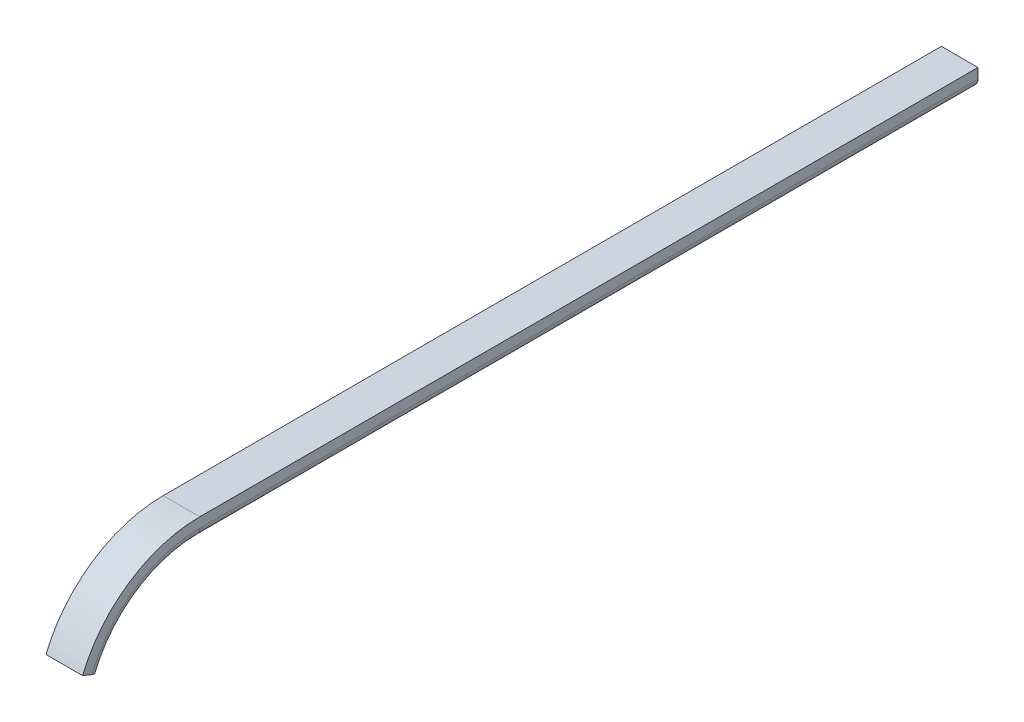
ISO-10303-21;
HEADER;
FILE_DESCRIPTION(('STEP AP214'),'2;1');
FILE_NAME('part.step','',(''),(''),'','','');
FILE_SCHEMA(('AUTOMOTIVE_DESIGN { 1 0 10303 214 1 1 1 1 }'));
ENDSEC;
DATA;
#1=APPLICATION_CONTEXT('core data for automotive mechanical design processes');
#2=APPLICATION_PROTOCOL_DEFINITION('international standard','automotive_design',2000,#1);
#3=PRODUCT_CONTEXT('',#1,'mechanical');
#4=PRODUCT('Part','Part','',(#3));
#5=PRODUCT_RELATED_PRODUCT_CATEGORY('part','',(#4));
#6=PRODUCT_DEFINITION_FORMATION('','',#4);
#7=PRODUCT_DEFINITION_CONTEXT('part definition',#1,'design');
#8=PRODUCT_DEFINITION('design','',#6,#7);
#9=PRODUCT_DEFINITION_SHAPE('','',#8);
#10=(LENGTH_UNIT() NAMED_UNIT(*) SI_UNIT(.MILLI.,.METRE.));
#11=(NAMED_UNIT(*) PLANE_ANGLE_UNIT() SI_UNIT($,.RADIAN.));
#12=(NAMED_UNIT(*) SI_UNIT($,.STERADIAN.) SOLID_ANGLE_UNIT());
#13=UNCERTAINTY_MEASURE_WITH_UNIT(LENGTH_MEASURE(1.E-05),#10,'distance_accuracy_value','');
#14=(GEOMETRIC_REPRESENTATION_CONTEXT(3) GLOBAL_UNCERTAINTY_ASSIGNED_CONTEXT((#13)) GLOBAL_UNIT_ASSIGNED_CONTEXT((#10,
#11,#12)) REPRESENTATION_CONTEXT('',''));
#15=CARTESIAN_POINT('',(0.,0.,0.));
#16=DIRECTION('',(0.,0.,1.));
#17=DIRECTION('',(1.,0.,0.));
#18=AXIS2_PLACEMENT_3D('',#15,#16,#17);
#19=CARTESIAN_POINT('',(0.,0.,425.));
#20=DIRECTION('',(1.,0.,0.));
#21=DIRECTION('',(0.,1.,0.));
#22=AXIS2_PLACEMENT_3D('',#19,#20,#21);
#23=PLANE('',#22);
#24=DIRECTION('',(0.,-1.,0.));
#25=VECTOR('',#24,1.);
#26=CARTESIAN_POINT('',(0.,0.,0.));
#27=LINE('',#26,#25);
#28=CARTESIAN_POINT('',(0.,0.,0.));
#29=VERTEX_POINT('',#28);
#30=CARTESIAN_POINT('',(0.,-3.,0.));
#31=VERTEX_POINT('',#30);
#32=EDGE_CURVE('E157',#29,#31,#27,.T.);
#33=ORIENTED_EDGE('',*,*,#32,.T.);
#34=DIRECTION('',(0.,0.,-1.));
#35=VECTOR('',#34,1.);
#36=CARTESIAN_POINT('',(0.,-3.,425.));
#37=LINE('',#36,#35);
#38=CARTESIAN_POINT('',(0.,-3.,425.));
#39=VERTEX_POINT('',#38);
#40=EDGE_CURVE('E11',#39,#31,#37,.T.);
#41=ORIENTED_EDGE('',*,*,#40,.F.);
#42=CARTESIAN_POINT('',(0.,-69.,425.));
#43=DIRECTION('',(-1.,0.,0.));
#44=DIRECTION('',(0.,0.,1.));
#45=AXIS2_PLACEMENT_3D('',#42,#43,#44);
#46=CIRCLE('',#45,66.);
#47=CARTESIAN_POINT('',(0.,-44.27596483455,486.194134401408));
#48=VERTEX_POINT('',#47);
#49=EDGE_CURVE('E272',#48,#39,#46,.T.);
#50=ORIENTED_EDGE('',*,*,#49,.F.);
#51=DIRECTION('',(0.,-0.37460659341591,-0.927183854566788));
#52=VECTOR('',#51,1.);
#53=CARTESIAN_POINT('',(0.,-44.27596483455,486.194134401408));
#54=LINE('',#53,#52);
#55=CARTESIAN_POINT('',(0.,-43.1521450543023,488.975685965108));
#56=VERTEX_POINT('',#55);
#57=EDGE_CURVE('E153',#56,#48,#54,.T.);
#58=ORIENTED_EDGE('',*,*,#57,.F.);
#59=CARTESIAN_POINT('',(0.,-69.,425.));
#60=DIRECTION('',(-1.,0.,0.));
#61=DIRECTION('',(0.,0.,1.));
#62=AXIS2_PLACEMENT_3D('',#59,#60,#61);
#63=CIRCLE('',#62,69.);
#64=CARTESIAN_POINT('',(0.,0.,425.));
#65=VERTEX_POINT('',#64);
#66=EDGE_CURVE('E151',#56,#65,#63,.T.);
#67=ORIENTED_EDGE('',*,*,#66,.T.);
#68=DIRECTION('',(0.,0.,-1.));
#69=VECTOR('',#68,1.);
#70=CARTESIAN_POINT('',(0.,0.,425.));
#71=LINE('',#70,#69);
#72=EDGE_CURVE('E138',#65,#29,#71,.T.);
#73=ORIENTED_EDGE('',*,*,#72,.T.);
#74=EDGE_LOOP('',(#33,#41,#50,#58,#67,#73));
#75=FACE_BOUND('',#74,.T.);
#76=ADVANCED_FACE('F32',(#75),#23,.F.);
#77=CARTESIAN_POINT('',(0.,-3.,425.));
#78=DIRECTION('',(0.,1.,0.));
#79=DIRECTION('',(-1.,0.,0.));
#80=AXIS2_PLACEMENT_3D('',#77,#78,#79);
#81=PLANE('',#80);
#82=DIRECTION('',(1.,0.,0.));
#83=VECTOR('',#82,1.);
#84=CARTESIAN_POINT('',(0.,-3.,0.));
#85=LINE('',#84,#83);
#86=CARTESIAN_POINT('',(17.,-3.,0.));
#87=VERTEX_POINT('',#86);
#88=EDGE_CURVE('E197',#31,#87,#85,.T.);
#89=ORIENTED_EDGE('',*,*,#88,.T.);
#90=DIRECTION('',(0.,0.,-1.));
#91=VECTOR('',#90,1.);
#92=CARTESIAN_POINT('',(17.,-3.,425.));
#93=LINE('',#92,#91);
#94=CARTESIAN_POINT('',(17.,-3.,425.));
#95=VERTEX_POINT('',#94);
#96=EDGE_CURVE('E39',#95,#87,#93,.T.);
#97=ORIENTED_EDGE('',*,*,#96,.F.);
#98=DIRECTION('',(1.,0.,0.));
#99=VECTOR('',#98,1.);
#100=CARTESIAN_POINT('',(0.,-3.,425.));
#101=LINE('',#100,#99);
#102=EDGE_CURVE('E216',#39,#95,#101,.T.);
#103=ORIENTED_EDGE('',*,*,#102,.F.);
#104=ORIENTED_EDGE('',*,*,#40,.T.);
#105=EDGE_LOOP('',(#89,#97,#103,#104));
#106=FACE_BOUND('',#105,.T.);
#107=ADVANCED_FACE('F305',(#106),#81,.F.);
#108=CARTESIAN_POINT('',(17.,-3.,425.));
#109=DIRECTION('',(1.,0.,0.));
#110=DIRECTION('',(0.,0.,-1.));
#111=AXIS2_PLACEMENT_3D('',#108,#109,#110);
#112=PLANE('',#111);
#113=DIRECTION('',(0.,-1.,0.));
#114=VECTOR('',#113,1.);
#115=CARTESIAN_POINT('',(17.,-3.,0.));
#116=LINE('',#115,#114);
#117=CARTESIAN_POINT('',(17.,-5.49999999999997,0.));
#118=VERTEX_POINT('',#117);
#119=EDGE_CURVE('E189',#87,#118,#116,.T.);
#120=ORIENTED_EDGE('',*,*,#119,.T.);
#121=DIRECTION('',(0.,0.,-1.));
#122=VECTOR('',#121,1.);
#123=CARTESIAN_POINT('',(17.,-5.49999999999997,425.));
#124=LINE('',#123,#122);
#125=CARTESIAN_POINT('',(17.,-5.49999999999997,425.));
#126=VERTEX_POINT('',#125);
#127=EDGE_CURVE('E182',#126,#118,#124,.T.);
#128=ORIENTED_EDGE('',*,*,#127,.F.);
#129=CARTESIAN_POINT('',(17.,-69.,425.));
#130=DIRECTION('',(-1.,0.,0.));
#131=DIRECTION('',(0.,0.,1.));
#132=AXIS2_PLACEMENT_3D('',#129,#130,#131);
#133=CIRCLE('',#132,63.5);
#134=CARTESIAN_POINT('',(17.,-45.2124813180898,483.876174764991));
#135=VERTEX_POINT('',#134);
#136=EDGE_CURVE('E275',#135,#126,#133,.T.);
#137=ORIENTED_EDGE('',*,*,#136,.F.);
#138=DIRECTION('',(0.,-0.37460659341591,-0.927183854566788));
#139=VECTOR('',#138,1.);
#140=CARTESIAN_POINT('',(17.,-45.2124813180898,483.876174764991));
#141=LINE('',#140,#139);
#142=CARTESIAN_POINT('',(17.,-44.27596483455,486.194134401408));
#143=VERTEX_POINT('',#142);
#144=EDGE_CURVE('E320',#143,#135,#141,.T.);
#145=ORIENTED_EDGE('',*,*,#144,.F.);
#146=CARTESIAN_POINT('',(17.,-69.,425.));
#147=DIRECTION('',(-1.,0.,0.));
#148=DIRECTION('',(0.,0.,1.));
#149=AXIS2_PLACEMENT_3D('',#146,#147,#148);
#150=CIRCLE('',#149,66.);
#151=EDGE_CURVE('E191',#143,#95,#150,.T.);
#152=ORIENTED_EDGE('',*,*,#151,.T.);
#153=ORIENTED_EDGE('',*,*,#96,.T.);
#154=EDGE_LOOP('',(#120,#128,#137,#145,#152,#153));
#155=FACE_BOUND('',#154,.T.);
#156=ADVANCED_FACE('F188',(#155),#112,.F.);
#157=CARTESIAN_POINT('',(15.5,-5.5,425.));
#158=DIRECTION('',(0.,0.,-1.));
#159=DIRECTION('',(-1.,0.,0.));
#160=AXIS2_PLACEMENT_3D('',#157,#158,#159);
#161=CYLINDRICAL_SURFACE('',#160,1.5);
#162=CARTESIAN_POINT('',(15.5,-5.5,0.));
#163=DIRECTION('',(0.,0.,-1.));
#164=DIRECTION('',(1.,0.,0.));
#165=AXIS2_PLACEMENT_3D('',#162,#163,#164);
#166=CIRCLE('',#165,1.5);
#167=CARTESIAN_POINT('',(15.1371171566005,-6.955443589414,0.));
#168=VERTEX_POINT('',#167);
#169=EDGE_CURVE('E199',#118,#168,#166,.T.);
#170=ORIENTED_EDGE('',*,*,#169,.T.);
#171=DIRECTION('',(0.,0.,-1.));
#172=VECTOR('',#171,1.);
#173=CARTESIAN_POINT('',(15.1371171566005,-6.955443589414,425.));
#174=LINE('',#173,#172);
#175=CARTESIAN_POINT('',(15.1371171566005,-6.955443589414,425.));
#176=VERTEX_POINT('',#175);
#177=EDGE_CURVE('E179',#176,#168,#174,.T.);
#178=ORIENTED_EDGE('',*,*,#177,.F.);
#179=CARTESIAN_POINT('',(15.5,-5.5,425.));
#180=DIRECTION('',(0.,0.,-1.));
#181=DIRECTION('',(1.,0.,0.));
#182=AXIS2_PLACEMENT_3D('',#179,#180,#181);
#183=CIRCLE('',#182,1.5);
#184=EDGE_CURVE('E218',#126,#176,#183,.T.);
#185=ORIENTED_EDGE('',*,*,#184,.F.);
#186=ORIENTED_EDGE('',*,*,#127,.T.);
#187=EDGE_LOOP('',(#170,#178,#185,#186));
#188=FACE_BOUND('',#187,.T.);
#189=ADVANCED_FACE('F302',(#188),#161,.F.);
#190=CARTESIAN_POINT('',(9.2996517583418,-5.5,425.));
#191=DIRECTION('',(-0.241921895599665,-0.970295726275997,0.));
#192=DIRECTION('',(0.970295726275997,-0.241921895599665,0.));
#193=AXIS2_PLACEMENT_3D('',#190,#191,#192);
#194=PLANE('',#193);
#195=DIRECTION('',(-0.970295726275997,0.241921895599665,0.));
#196=VECTOR('',#195,1.);
#197=CARTESIAN_POINT('',(9.2996517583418,-5.5,0.));
#198=LINE('',#197,#196);
#199=CARTESIAN_POINT('',(9.2996517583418,-5.5,0.));
#200=VERTEX_POINT('',#199);
#201=EDGE_CURVE('E201',#168,#200,#198,.T.);
#202=ORIENTED_EDGE('',*,*,#201,.T.);
#203=DIRECTION('',(0.,0.,-1.));
#204=VECTOR('',#203,1.);
#205=CARTESIAN_POINT('',(9.2996517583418,-5.5,425.));
#206=LINE('',#205,#204);
#207=CARTESIAN_POINT('',(9.2996517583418,-5.5,425.));
#208=VERTEX_POINT('',#207);
#209=EDGE_CURVE('E176',#208,#200,#206,.T.);
#210=ORIENTED_EDGE('',*,*,#209,.F.);
#211=DIRECTION('',(-0.970295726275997,0.241921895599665,0.));
#212=VECTOR('',#211,1.);
#213=CARTESIAN_POINT('',(9.2996517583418,-5.5,425.));
#214=LINE('',#213,#212);
#215=EDGE_CURVE('E221',#176,#208,#214,.T.);
#216=ORIENTED_EDGE('',*,*,#215,.F.);
#217=ORIENTED_EDGE('',*,*,#177,.T.);
#218=EDGE_LOOP('',(#202,#210,#216,#217));
#219=FACE_BOUND('',#218,.T.);
#220=ADVANCED_FACE('F291',(#219),#194,.F.);
#221=CARTESIAN_POINT('',(8.57388607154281,-8.41088717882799,425.));
#222=DIRECTION('',(0.970295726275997,-0.241921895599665,0.));
#223=DIRECTION('',(0.241921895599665,0.970295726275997,0.));
#224=AXIS2_PLACEMENT_3D('',#221,#222,#223);
#225=PLANE('',#224);
#226=DIRECTION('',(-0.241921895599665,-0.970295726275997,0.));
#227=VECTOR('',#226,1.);
#228=CARTESIAN_POINT('',(8.57388607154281,-8.41088717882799,0.));
#229=LINE('',#228,#227);
#230=CARTESIAN_POINT('',(8.57388607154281,-8.41088717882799,0.));
#231=VERTEX_POINT('',#230);
#232=EDGE_CURVE('E207',#200,#231,#229,.T.);
#233=ORIENTED_EDGE('',*,*,#232,.T.);
#234=DIRECTION('',(0.,0.,-1.));
#235=VECTOR('',#234,1.);
#236=CARTESIAN_POINT('',(8.57388607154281,-8.41088717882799,425.));
#237=LINE('',#236,#235);
#238=CARTESIAN_POINT('',(8.57388607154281,-8.41088717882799,425.));
#239=VERTEX_POINT('',#238);
#240=EDGE_CURVE('E173',#239,#231,#237,.T.);
#241=ORIENTED_EDGE('',*,*,#240,.F.);
#242=DIRECTION('',(-0.241921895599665,-0.970295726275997,0.));
#243=VECTOR('',#242,1.);
#244=CARTESIAN_POINT('',(8.57388607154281,-8.41088717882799,425.));
#245=LINE('',#244,#243);
#246=EDGE_CURVE('E224',#208,#239,#245,.T.);
#247=ORIENTED_EDGE('',*,*,#246,.F.);
#248=ORIENTED_EDGE('',*,*,#209,.T.);
#249=EDGE_LOOP('',(#233,#241,#247,#248));
#250=FACE_BOUND('',#249,.T.);
#251=ADVANCED_FACE('F294',(#250),#225,.F.);
#252=CARTESIAN_POINT('',(14.4113514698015,-9.86633076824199,425.));
#253=DIRECTION('',(0.241921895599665,0.970295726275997,0.));
#254=DIRECTION('',(-0.970295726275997,0.241921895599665,0.));
#255=AXIS2_PLACEMENT_3D('',#252,#253,#254);
#256=PLANE('',#255);
#257=DIRECTION('',(0.970295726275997,-0.241921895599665,0.));
#258=VECTOR('',#257,1.);
#259=CARTESIAN_POINT('',(14.4113514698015,-9.86633076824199,0.));
#260=LINE('',#259,#258);
#261=CARTESIAN_POINT('',(14.4113514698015,-9.86633076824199,0.));
#262=VERTEX_POINT('',#261);
#263=EDGE_CURVE('E209',#231,#262,#260,.T.);
#264=ORIENTED_EDGE('',*,*,#263,.T.);
#265=DIRECTION('',(0.,0.,-1.));
#266=VECTOR('',#265,1.);
#267=CARTESIAN_POINT('',(14.4113514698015,-9.86633076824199,425.));
#268=LINE('',#267,#266);
#269=CARTESIAN_POINT('',(14.4113514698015,-9.86633076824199,425.));
#270=VERTEX_POINT('',#269);
#271=EDGE_CURVE('E170',#270,#262,#268,.T.);
#272=ORIENTED_EDGE('',*,*,#271,.F.);
#273=DIRECTION('',(0.970295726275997,-0.241921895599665,0.));
#274=VECTOR('',#273,1.);
#275=CARTESIAN_POINT('',(14.4113514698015,-9.86633076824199,425.));
#276=LINE('',#275,#274);
#277=EDGE_CURVE('E164',#239,#270,#276,.T.);
#278=ORIENTED_EDGE('',*,*,#277,.F.);
#279=ORIENTED_EDGE('',*,*,#240,.T.);
#280=EDGE_LOOP('',(#264,#272,#278,#279));
#281=FACE_BOUND('',#280,.T.);
#282=ADVANCED_FACE('F237',(#281),#256,.F.);
#283=CARTESIAN_POINT('',(15.5,-5.5,425.));
#284=DIRECTION('',(0.,0.,-1.));
#285=DIRECTION('',(-1.,0.,0.));
#286=AXIS2_PLACEMENT_3D('',#283,#284,#285);
#287=CYLINDRICAL_SURFACE('',#286,4.5);
#288=CARTESIAN_POINT('',(15.5,-5.5,0.));
#289=DIRECTION('',(0.,0.,1.));
#290=DIRECTION('',(-1.,0.,0.));
#291=AXIS2_PLACEMENT_3D('',#288,#289,#290);
#292=CIRCLE('',#291,4.5);
#293=CARTESIAN_POINT('',(20.,-5.5,0.));
#294=VERTEX_POINT('',#293);
#295=EDGE_CURVE('E211',#262,#294,#292,.T.);
#296=ORIENTED_EDGE('',*,*,#295,.T.);
#297=DIRECTION('',(0.,0.,-1.));
#298=VECTOR('',#297,1.);
#299=CARTESIAN_POINT('',(20.,-5.5,425.));
#300=LINE('',#299,#298);
#301=CARTESIAN_POINT('',(20.,-5.5,425.));
#302=VERTEX_POINT('',#301);
#303=EDGE_CURVE('E54',#302,#294,#300,.T.);
#304=ORIENTED_EDGE('',*,*,#303,.F.);
#305=CARTESIAN_POINT('',(15.5,-5.5,425.));
#306=DIRECTION('',(0.,0.,1.));
#307=DIRECTION('',(-1.,0.,0.));
#308=AXIS2_PLACEMENT_3D('',#305,#306,#307);
#309=CIRCLE('',#308,4.5);
#310=EDGE_CURVE('E161',#270,#302,#309,.T.);
#311=ORIENTED_EDGE('',*,*,#310,.F.);
#312=ORIENTED_EDGE('',*,*,#271,.T.);
#313=EDGE_LOOP('',(#296,#304,#311,#312));
#314=FACE_BOUND('',#313,.T.);
#315=ADVANCED_FACE('F240',(#314),#287,.T.);
#316=CARTESIAN_POINT('',(20.,0.,425.));
#317=DIRECTION('',(-1.,0.,0.));
#318=DIRECTION('',(0.,0.,1.));
#319=AXIS2_PLACEMENT_3D('',#316,#317,#318);
#320=PLANE('',#319);
#321=DIRECTION('',(0.,1.,0.));
#322=VECTOR('',#321,1.);
#323=CARTESIAN_POINT('',(20.,0.,0.));
#324=LINE('',#323,#322);
#325=CARTESIAN_POINT('',(20.,0.,0.));
#326=VERTEX_POINT('',#325);
#327=EDGE_CURVE('E213',#294,#326,#324,.T.);
#328=ORIENTED_EDGE('',*,*,#327,.T.);
#329=DIRECTION('',(0.,0.,-1.));
#330=VECTOR('',#329,1.);
#331=CARTESIAN_POINT('',(20.,0.,425.));
#332=LINE('',#331,#330);
#333=CARTESIAN_POINT('',(20.,0.,425.));
#334=VERTEX_POINT('',#333);
#335=EDGE_CURVE('E46',#334,#326,#332,.T.);
#336=ORIENTED_EDGE('',*,*,#335,.F.);
#337=CARTESIAN_POINT('',(20.,-69.,425.));
#338=DIRECTION('',(-1.,0.,0.));
#339=DIRECTION('',(0.,0.,1.));
#340=AXIS2_PLACEMENT_3D('',#337,#338,#339);
#341=CIRCLE('',#340,69.);
#342=CARTESIAN_POINT('',(20.,-43.1521450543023,488.975685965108));
#343=VERTEX_POINT('',#342);
#344=EDGE_CURVE('E158',#343,#334,#341,.T.);
#345=ORIENTED_EDGE('',*,*,#344,.F.);
#346=DIRECTION('',(0.,0.37460659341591,0.927183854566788));
#347=VECTOR('',#346,1.);
#348=CARTESIAN_POINT('',(20.,-43.1521450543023,488.975685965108));
#349=LINE('',#348,#347);
#350=CARTESIAN_POINT('',(20.,-45.2124813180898,483.876174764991));
#351=VERTEX_POINT('',#350);
#352=EDGE_CURVE('E259',#351,#343,#349,.T.);
#353=ORIENTED_EDGE('',*,*,#352,.F.);
#354=CARTESIAN_POINT('',(20.,-69.,425.));
#355=DIRECTION('',(-1.,0.,0.));
#356=DIRECTION('',(0.,0.,1.));
#357=AXIS2_PLACEMENT_3D('',#354,#355,#356);
#358=CIRCLE('',#357,63.5);
#359=EDGE_CURVE('E246',#351,#302,#358,.T.);
#360=ORIENTED_EDGE('',*,*,#359,.T.);
#361=ORIENTED_EDGE('',*,*,#303,.T.);
#362=EDGE_LOOP('',(#328,#336,#345,#353,#360,#361));
#363=FACE_BOUND('',#362,.T.);
#364=ADVANCED_FACE('F256',(#363),#320,.F.);
#365=CARTESIAN_POINT('',(0.,0.,425.));
#366=DIRECTION('',(0.,-1.,0.));
#367=DIRECTION('',(0.,0.,-1.));
#368=AXIS2_PLACEMENT_3D('',#365,#366,#367);
#369=PLANE('',#368);
#370=DIRECTION('',(-1.,0.,0.));
#371=VECTOR('',#370,1.);
#372=CARTESIAN_POINT('',(0.,0.,0.));
#373=LINE('',#372,#371);
#374=EDGE_CURVE('E145',#326,#29,#373,.T.);
#375=ORIENTED_EDGE('',*,*,#374,.T.);
#376=ORIENTED_EDGE('',*,*,#72,.F.);
#377=DIRECTION('',(-1.,0.,0.));
#378=VECTOR('',#377,1.);
#379=CARTESIAN_POINT('',(0.,0.,425.));
#380=LINE('',#379,#378);
#381=EDGE_CURVE('E142',#334,#65,#380,.T.);
#382=ORIENTED_EDGE('',*,*,#381,.F.);
#383=ORIENTED_EDGE('',*,*,#335,.T.);
#384=EDGE_LOOP('',(#375,#376,#382,#383));
#385=FACE_BOUND('',#384,.T.);
#386=ADVANCED_FACE('F140',(#385),#369,.F.);
#387=CARTESIAN_POINT('',(15.5,-5.5,0.));
#388=DIRECTION('',(0.,0.,1.));
#389=DIRECTION('',(1.,0.,0.));
#390=AXIS2_PLACEMENT_3D('',#387,#388,#389);
#391=PLANE('',#390);
#392=ORIENTED_EDGE('',*,*,#32,.F.);
#393=ORIENTED_EDGE('',*,*,#374,.F.);
#394=ORIENTED_EDGE('',*,*,#327,.F.);
#395=ORIENTED_EDGE('',*,*,#295,.F.);
#396=ORIENTED_EDGE('',*,*,#263,.F.);
#397=ORIENTED_EDGE('',*,*,#232,.F.);
#398=ORIENTED_EDGE('',*,*,#201,.F.);
#399=ORIENTED_EDGE('',*,*,#169,.F.);
#400=ORIENTED_EDGE('',*,*,#119,.F.);
#401=ORIENTED_EDGE('',*,*,#88,.F.);
#402=EDGE_LOOP('',(#392,#393,#394,#395,#396,#397,#398,#399,#400,#401));
#403=FACE_BOUND('',#402,.T.);
#404=ADVANCED_FACE('F196',(#403),#391,.F.);
#405=CARTESIAN_POINT('',(-2.53690537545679,-69.,425.));
#406=DIRECTION('',(-1.,0.,0.));
#407=DIRECTION('',(0.,0.,1.));
#408=AXIS2_PLACEMENT_3D('',#405,#406,#407);
#409=CYLINDRICAL_SURFACE('',#408,69.);
#410=ORIENTED_EDGE('',*,*,#344,.T.);
#411=ORIENTED_EDGE('',*,*,#381,.T.);
#412=ORIENTED_EDGE('',*,*,#66,.F.);
#413=DIRECTION('',(-1.,0.,0.));
#414=VECTOR('',#413,1.);
#415=CARTESIAN_POINT('',(0.,-43.1521450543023,488.975685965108));
#416=LINE('',#415,#414);
#417=EDGE_CURVE('E265',#343,#56,#416,.T.);
#418=ORIENTED_EDGE('',*,*,#417,.F.);
#419=EDGE_LOOP('',(#410,#411,#412,#418));
#420=FACE_BOUND('',#419,.T.);
#421=ADVANCED_FACE('F160',(#420),#409,.T.);
#422=CARTESIAN_POINT('',(15.5,-69.,425.));
#423=DIRECTION('',(-1.,0.,0.));
#424=DIRECTION('',(0.,0.,1.));
#425=AXIS2_PLACEMENT_3D('',#422,#423,#424);
#426=TOROIDAL_SURFACE('',#425,63.5,4.50000000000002);
#427=CARTESIAN_POINT('',(14.4113514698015,-69.,425.));
#428=DIRECTION('',(-1.,0.,0.));
#429=DIRECTION('',(0.,0.,1.));
#430=AXIS2_PLACEMENT_3D('',#427,#428,#429);
#431=CIRCLE('',#430,59.133669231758);
#432=CARTESIAN_POINT('',(14.4113514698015,-46.848137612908,479.827783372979));
#433=VERTEX_POINT('',#432);
#434=EDGE_CURVE('E233',#433,#270,#431,.T.);
#435=ORIENTED_EDGE('',*,*,#434,.T.);
#436=ORIENTED_EDGE('',*,*,#310,.T.);
#437=ORIENTED_EDGE('',*,*,#359,.F.);
#438=CARTESIAN_POINT('',(15.5,-45.2124813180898,483.876174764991));
#439=DIRECTION('',(0.,-0.927183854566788,0.37460659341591));
#440=DIRECTION('',(-1.,0.,0.));
#441=AXIS2_PLACEMENT_3D('',#438,#439,#440);
#442=CIRCLE('',#441,4.50000000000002);
#443=EDGE_CURVE('E245',#433,#351,#442,.T.);
#444=ORIENTED_EDGE('',*,*,#443,.F.);
#445=EDGE_LOOP('',(#435,#436,#437,#444));
#446=FACE_BOUND('',#445,.T.);
#447=ADVANCED_FACE('F243',(#446),#426,.T.);
#448=CARTESIAN_POINT('',(8.57388607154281,-69.,425.));
#449=DIRECTION('',(-1.,0.,0.));
#450=DIRECTION('',(0.,0.,1.));
#451=AXIS2_PLACEMENT_3D('',#448,#449,#450);
#452=CONICAL_SURFACE('',#451,60.589112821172,0.244346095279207);
#453=CARTESIAN_POINT('',(8.57388607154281,-69.,425.));
#454=DIRECTION('',(-1.,0.,0.));
#455=DIRECTION('',(0.,0.,1.));
#456=AXIS2_PLACEMENT_3D('',#453,#454,#455);
#457=CIRCLE('',#456,60.589112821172);
#458=CARTESIAN_POINT('',(8.57388607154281,-46.3029188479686,481.177247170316));
#459=VERTEX_POINT('',#458);
#460=EDGE_CURVE('E235',#459,#239,#457,.T.);
#461=ORIENTED_EDGE('',*,*,#460,.T.);
#462=ORIENTED_EDGE('',*,*,#277,.T.);
#463=ORIENTED_EDGE('',*,*,#434,.F.);
#464=DIRECTION('',(0.970295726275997,-0.0906255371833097,-0.224306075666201));
#465=VECTOR('',#464,1.);
#466=CARTESIAN_POINT('',(14.4113514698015,-46.848137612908,479.827783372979));
#467=LINE('',#466,#465);
#468=EDGE_CURVE('E263',#459,#433,#467,.T.);
#469=ORIENTED_EDGE('',*,*,#468,.F.);
#470=EDGE_LOOP('',(#461,#462,#463,#469));
#471=FACE_BOUND('',#470,.T.);
#472=ADVANCED_FACE('F230',(#471),#452,.F.);
#473=CARTESIAN_POINT('',(9.2996517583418,-69.,425.));
#474=DIRECTION('',(1.,0.,0.));
#475=DIRECTION('',(0.,0.,-1.));
#476=AXIS2_PLACEMENT_3D('',#473,#474,#475);
#477=CONICAL_SURFACE('',#476,63.5,1.32645023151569);
#478=CARTESIAN_POINT('',(9.2996517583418,-69.,425.));
#479=DIRECTION('',(-1.,0.,0.));
#480=DIRECTION('',(0.,0.,1.));
#481=AXIS2_PLACEMENT_3D('',#478,#479,#480);
#482=CIRCLE('',#481,63.5);
#483=CARTESIAN_POINT('',(9.2996517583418,-45.2124813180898,483.876174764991));
#484=VERTEX_POINT('',#483);
#485=EDGE_CURVE('E249',#484,#208,#482,.T.);
#486=ORIENTED_EDGE('',*,*,#485,.T.);
#487=ORIENTED_EDGE('',*,*,#246,.T.);
#488=ORIENTED_EDGE('',*,*,#460,.F.);
#489=DIRECTION('',(-0.241921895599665,-0.363479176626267,-0.899642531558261));
#490=VECTOR('',#489,1.);
#491=CARTESIAN_POINT('',(8.57388607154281,-46.3029188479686,481.177247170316));
#492=LINE('',#491,#490);
#493=EDGE_CURVE('E267',#484,#459,#492,.T.);
#494=ORIENTED_EDGE('',*,*,#493,.F.);
#495=EDGE_LOOP('',(#486,#487,#488,#494));
#496=FACE_BOUND('',#495,.T.);
#497=ADVANCED_FACE('F283',(#496),#477,.T.);
#498=CARTESIAN_POINT('',(15.1371171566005,-69.,425.));
#499=DIRECTION('',(-1.,0.,0.));
#500=DIRECTION('',(0.,0.,1.));
#501=AXIS2_PLACEMENT_3D('',#498,#499,#500);
#502=CONICAL_SURFACE('',#501,62.044556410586,0.244346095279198);
#503=CARTESIAN_POINT('',(15.1371171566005,-69.,425.));
#504=DIRECTION('',(-1.,0.,0.));
#505=DIRECTION('',(0.,0.,1.));
#506=AXIS2_PLACEMENT_3D('',#503,#504,#505);
#507=CIRCLE('',#506,62.044556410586);
#508=CARTESIAN_POINT('',(15.1371171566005,-45.7577000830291,482.526710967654));
#509=VERTEX_POINT('',#508);
#510=EDGE_CURVE('E278',#509,#176,#507,.T.);
#511=ORIENTED_EDGE('',*,*,#510,.T.);
#512=ORIENTED_EDGE('',*,*,#215,.T.);
#513=ORIENTED_EDGE('',*,*,#485,.F.);
#514=DIRECTION('',(-0.970295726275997,0.09062553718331,0.224306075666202));
#515=VECTOR('',#514,1.);
#516=CARTESIAN_POINT('',(9.2996517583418,-45.2124813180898,483.876174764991));
#517=LINE('',#516,#515);
#518=EDGE_CURVE('E330',#509,#484,#517,.T.);
#519=ORIENTED_EDGE('',*,*,#518,.F.);
#520=EDGE_LOOP('',(#511,#512,#513,#519));
#521=FACE_BOUND('',#520,.T.);
#522=ADVANCED_FACE('F289',(#521),#502,.T.);
#523=CARTESIAN_POINT('',(15.5,-69.,425.));
#524=DIRECTION('',(-1.,0.,0.));
#525=DIRECTION('',(0.,0.,1.));
#526=AXIS2_PLACEMENT_3D('',#523,#524,#525);
#527=TOROIDAL_SURFACE('',#526,63.5,1.50000000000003);
#528=ORIENTED_EDGE('',*,*,#136,.T.);
#529=ORIENTED_EDGE('',*,*,#184,.T.);
#530=ORIENTED_EDGE('',*,*,#510,.F.);
#531=CARTESIAN_POINT('',(15.5,-45.2124813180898,483.876174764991));
#532=DIRECTION('',(0.,0.927183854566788,-0.37460659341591));
#533=DIRECTION('',(1.,0.,0.));
#534=AXIS2_PLACEMENT_3D('',#531,#532,#533);
#535=CIRCLE('',#534,1.50000000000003);
#536=EDGE_CURVE('E325',#135,#509,#535,.T.);
#537=ORIENTED_EDGE('',*,*,#536,.F.);
#538=EDGE_LOOP('',(#528,#529,#530,#537));
#539=FACE_BOUND('',#538,.T.);
#540=ADVANCED_FACE('F329',(#539),#527,.F.);
#541=CARTESIAN_POINT('',(-2.53690537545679,-69.,425.));
#542=DIRECTION('',(-1.,0.,0.));
#543=DIRECTION('',(0.,0.,1.));
#544=AXIS2_PLACEMENT_3D('',#541,#542,#543);
#545=CYLINDRICAL_SURFACE('',#544,66.);
#546=DIRECTION('',(1.,0.,0.));
#547=VECTOR('',#546,1.);
#548=CARTESIAN_POINT('',(17.,-44.27596483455,486.194134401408));
#549=LINE('',#548,#547);
#550=EDGE_CURVE('E327',#48,#143,#549,.T.);
#551=ORIENTED_EDGE('',*,*,#550,.F.);
#552=ORIENTED_EDGE('',*,*,#49,.T.);
#553=ORIENTED_EDGE('',*,*,#102,.T.);
#554=ORIENTED_EDGE('',*,*,#151,.F.);
#555=EDGE_LOOP('',(#551,#552,#553,#554));
#556=FACE_BOUND('',#555,.T.);
#557=ADVANCED_FACE('F336',(#556),#545,.F.);
#558=CARTESIAN_POINT('',(15.5,-45.2124813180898,483.876174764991));
#559=DIRECTION('',(0.,0.927183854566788,-0.37460659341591));
#560=DIRECTION('',(-1.,0.,0.));
#561=AXIS2_PLACEMENT_3D('',#558,#559,#560);
#562=PLANE('',#561);
#563=ORIENTED_EDGE('',*,*,#57,.T.);
#564=ORIENTED_EDGE('',*,*,#550,.T.);
#565=ORIENTED_EDGE('',*,*,#144,.T.);
#566=ORIENTED_EDGE('',*,*,#536,.T.);
#567=ORIENTED_EDGE('',*,*,#518,.T.);
#568=ORIENTED_EDGE('',*,*,#493,.T.);
#569=ORIENTED_EDGE('',*,*,#468,.T.);
#570=ORIENTED_EDGE('',*,*,#443,.T.);
#571=ORIENTED_EDGE('',*,*,#352,.T.);
#572=ORIENTED_EDGE('',*,*,#417,.T.);
#573=EDGE_LOOP('',(#563,#564,#565,#566,#567,#568,#569,#570,#571,#572));
#574=FACE_BOUND('',#573,.T.);
#575=ADVANCED_FACE('F261',(#574),#562,.F.);
#576=CLOSED_SHELL('',(#76,#107,#156,#189,#220,#251,#282,#315,#364,#386,#404,#421,#447,#472,#497,
#522,#540,#557,#575));
#577=MANIFOLD_SOLID_BREP('B2',#576);
#578=ADVANCED_BREP_SHAPE_REPRESENTATION('',(#18,#577),#14);
#579=SHAPE_DEFINITION_REPRESENTATION(#9,#578);
ENDSEC;
END-ISO-10303-21;
